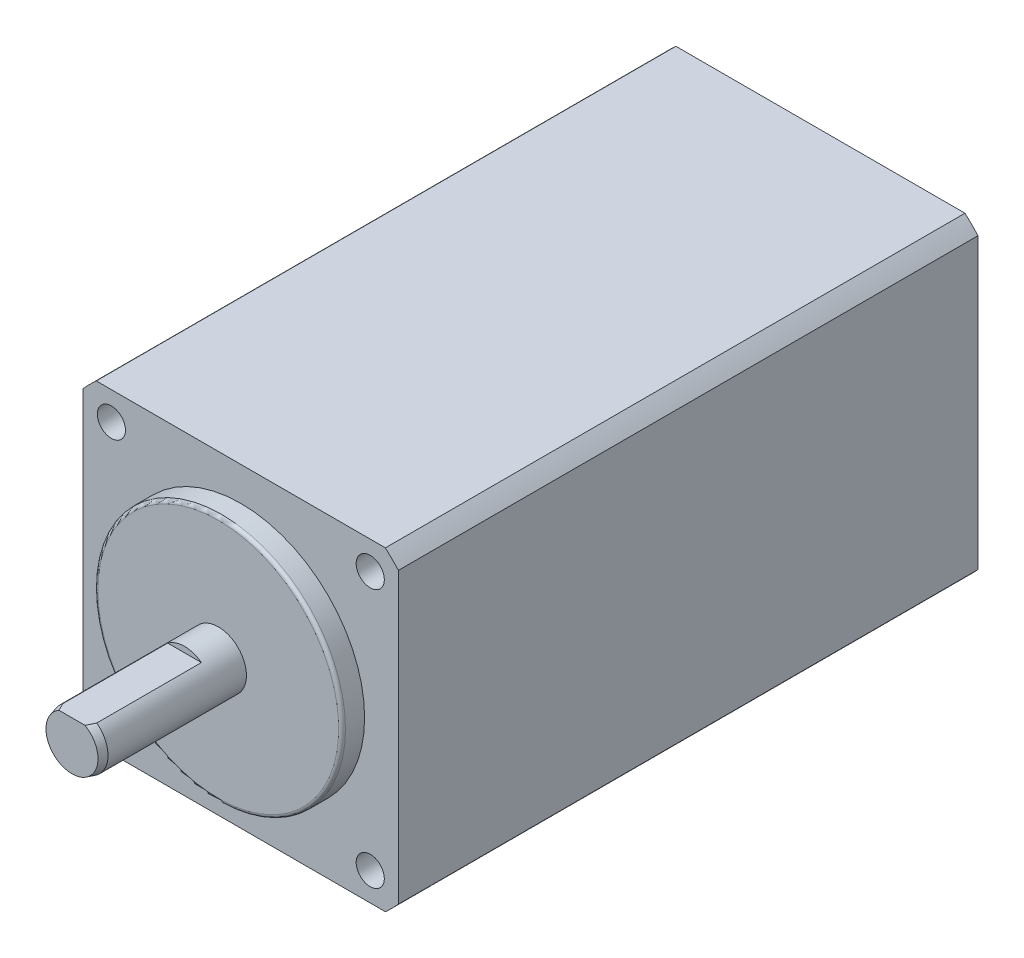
from build123d import *

# Parameters (mm, degrees)
SKETCH1_R      = 2.5
EXTRUDE1_DEPTH = 15
SKETCH2_R      = 11
EXTRUDE2_DEPTH = 2
EXTRUDE3_DEPTH = 51.5
SKETCH4_W      = 15.2
SKETCH4_H      = 9.5
EXTRUDE4_DEPTH = 5
SKETCH5_W      = 5.160305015
SKETCH5_H      = 2.199474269
EXTRUDE5_DEPTH = 10
CHAMFER1_SIZE  = 0.7
CHAMFER1_SIZE2 = 0.187564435
SKETCH6_R      = 1.25
EXTRUDE6_DEPTH = 4.5
FILLET2_R      = 0.3
EXTRUDE7_START = 10
EXTRUDE7_DEPTH = 10
CHAMFER2_SIZE  = 0.7
CHAMFER2_SIZE2 = 0.187564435


with BuildPart() as part:
    # Sketch1 → Extrude1 (new body)
    with BuildSketch(Plane.XY):
        Circle(SKETCH1_R)
    extrude(amount=EXTRUDE1_DEPTH)

    # Sketch2 → Extrude2 (add)
    with BuildSketch(Plane(origin=(0, 0, 0), x_dir=(-1, 0, 0), z_dir=(0, 0, -1))):
        Circle(SKETCH2_R)
    extrude(amount=-EXTRUDE2_DEPTH)

    # Sketch5 → Extrude5 (cut)
    with BuildSketch(Plane.XY.offset(15)):
        with Locations((0.042297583, 3.099737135)):
            Rectangle(SKETCH5_W, SKETCH5_H)
    extrude(amount=-EXTRUDE5_DEPTH, mode=Mode.SUBTRACT)

    # Chamfer1
    chamfer1_edges = [part.edges().sort_by_distance(p)[0] for p in [
        (-1.118033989, -2.236067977, 15),
    ]]
    chamfer1_side = [part.faces().sort_by_distance(p)[0] for p in [
        (-2.5, 0, 8.5),
    ]]
    chamfer(chamfer1_edges, length=CHAMFER1_SIZE, length2=CHAMFER1_SIZE2, reference=chamfer1_side[0])

    # Fillet2
    fillet2_edges = [part.edges().sort_by_distance(p)[0] for p in [
        (11, 0, 2),
    ]]
    fillet(fillet2_edges, radius=FILLET2_R)


with BuildPart() as body_2:
    # Sketch3 → Extrude3 (new body)
    with BuildSketch(Plane(origin=(0, 0, 0), x_dir=(-1, 0, 0), z_dir=(0, 0, -1))):
        with BuildLine():
            Line((-12.845232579, -14), (12.845232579, -14))
            ThreePointArc((12.845232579, -14), (13.435028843, -13.435028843), (14, -12.845232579))
            Line((14, -12.845232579), (14, 12.845232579))
            ThreePointArc((14, 12.845232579), (13.435028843, 13.435028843), (12.845232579, 14))
            Line((12.845232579, 14), (-12.845232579, 14))
            ThreePointArc((-12.845232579, 14), (-13.435028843, 13.435028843), (-14, 12.845232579))
            Line((-14, 12.845232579), (-14, -12.845232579))
            ThreePointArc((-14, -12.845232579), (-13.435028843, -13.435028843), (-12.845232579, -14))
        make_face()
    extrude(amount=EXTRUDE3_DEPTH)

    # Sketch4 → Extrude4 (add)
    with BuildSketch(Plane.XZ.offset(14)):
        with Locations((0, -46.75)):
            Rectangle(SKETCH4_W, SKETCH4_H)
    extrude(amount=EXTRUDE4_DEPTH)

    # Sketch6 → Extrude6 (cut)
    with BuildSketch(Plane.XY):
        with Locations((-11.5, 11.5)):
            Circle(SKETCH6_R)
        with Locations((11.5, 11.5)):
            Circle(SKETCH6_R)
        with Locations((-11.5, -11.5)):
            Circle(SKETCH6_R)
        with Locations((11.5, -11.5)):
            Circle(SKETCH6_R)
    extrude(amount=-EXTRUDE6_DEPTH, mode=Mode.SUBTRACT)

    # Sketch7 → Extrude7 (add)
    with BuildSketch(Plane(origin=(0, 0, -51.5), x_dir=(-1, 0, 0), z_dir=(0, 0, -1)).offset(EXTRUDE7_START)):
        with BuildLine():
            Line((1.5, 2), (-1.5, 2))
            ThreePointArc((-1.5, 2), (-1.118033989, -2.236067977), (2.5, 0))
            ThreePointArc((2.5, 0), (2.236067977, 1.118033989), (1.5, 2))
        make_face()
    extrude(amount=-EXTRUDE7_DEPTH)

    # Chamfer2
    chamfer2_edges = [body_2.edges().sort_by_distance(p)[0] for p in [
        (1.118033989, -2.236067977, -61.5),
    ]]
    chamfer2_side = [body_2.faces().sort_by_distance(p)[0] for p in [
        (1.118033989, -2.236067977, -56.5),
    ]]
    chamfer(chamfer2_edges, length=CHAMFER2_SIZE, length2=CHAMFER2_SIZE2, reference=chamfer2_side[0])


solid = Compound([part.part, body_2.part])
